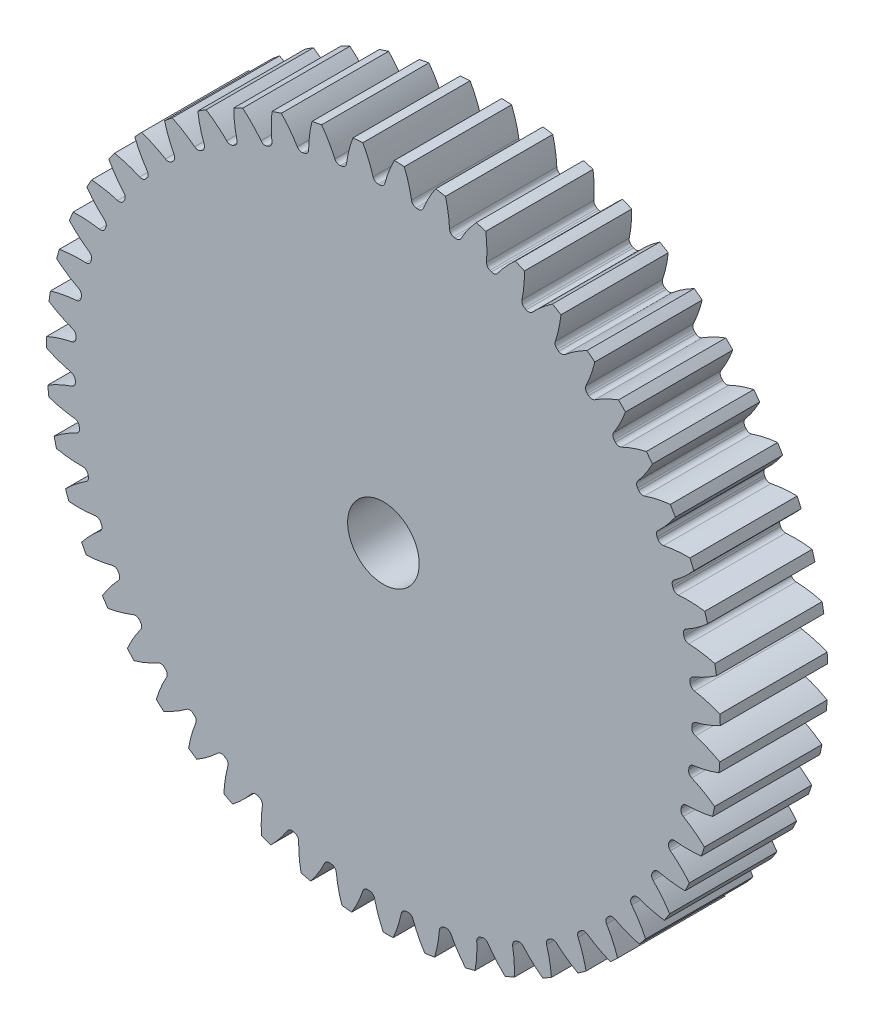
from build123d import *

# Parameters (mm, degrees)
SKETCH3_R         = 299.155555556
GEARBODY_DEPTH    = 95.25
TOOTHCUT_DEPTH    = 434.659607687
CIRPATTERN1_COUNT = 51
BOREDIA_R         = 31.75
BORE_DEPTH        = 12700


with BuildPart() as part:
    # Sketch3 → gearBody (new body)
    with BuildSketch(Plane.XY):
        Circle(SKETCH3_R)
    extrude(amount=GEARBODY_DEPTH)

    # Sketch2 → toothCut (cut, through all)
    with BuildSketch(Plane.XY):
        with BuildLine():
            ThreePointArc((273.704410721, -5.291478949), (273.718343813, -4.513585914), (273.730066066, -3.735656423))
            ThreePointArc((273.730066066, -3.735656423), (274.702517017, -0.971086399), (277.14842976, 0.643230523))
            ThreePointArc((277.14842976, 0.643230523), (288.38931969, 4.297996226), (299.155555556, 9.176836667))
            ThreePointArc((299.155555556, 9.176836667), (299.255592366, -4.934692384), (298.69034128, -19.035250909))
            ThreePointArc((298.69034128, -19.035250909), (288.090818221, -13.804091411), (276.976540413, -9.780691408))
            ThreePointArc((276.976540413, -9.780691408), (274.585182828, -8.086608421), (273.704410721, -5.291478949))
        make_face()
    toothcut = extrude(amount=TOOTHCUT_DEPTH, mode=Mode.SUBTRACT)

    # CirPattern1: toothCut ×51 about axis
    cirpattern1_axis = Axis((0, 0, 0), (0, 0, 1))
    for i in range(1, CIRPATTERN1_COUNT):
        add(toothcut.rotate(cirpattern1_axis, i * 360 / CIRPATTERN1_COUNT), mode=Mode.SUBTRACT)

    # boreDia → bore (cut, symmetric)
    with BuildSketch(Plane.XY):
        Circle(BOREDIA_R)
    extrude(amount=BORE_DEPTH, both=True, mode=Mode.SUBTRACT)


solid = part.part
